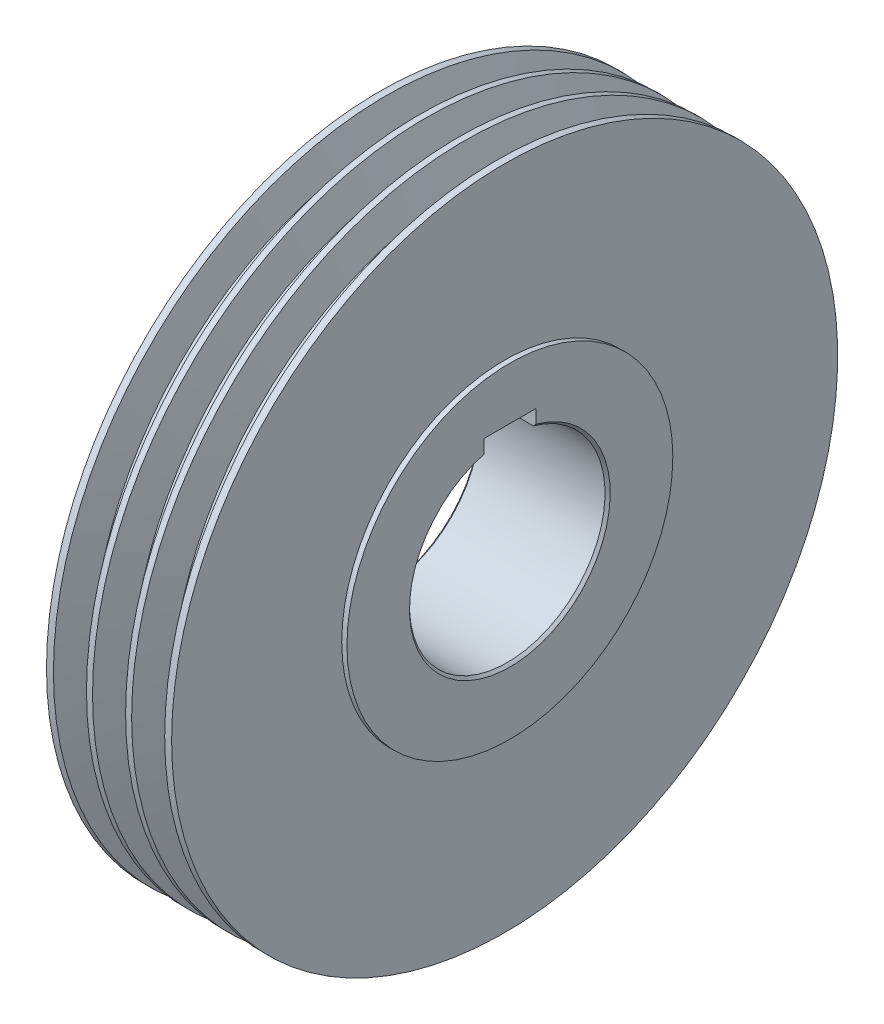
ISO-10303-21;
HEADER;
FILE_DESCRIPTION(('STEP AP214'),'2;1');
FILE_NAME('part.step','',(''),(''),'','','');
FILE_SCHEMA(('AUTOMOTIVE_DESIGN { 1 0 10303 214 1 1 1 1 }'));
ENDSEC;
DATA;
#1=APPLICATION_CONTEXT('core data for automotive mechanical design processes');
#2=APPLICATION_PROTOCOL_DEFINITION('international standard','automotive_design',2000,#1);
#3=PRODUCT_CONTEXT('',#1,'mechanical');
#4=PRODUCT('Part','Part','',(#3));
#5=PRODUCT_RELATED_PRODUCT_CATEGORY('part','',(#4));
#6=PRODUCT_DEFINITION_FORMATION('','',#4);
#7=PRODUCT_DEFINITION_CONTEXT('part definition',#1,'design');
#8=PRODUCT_DEFINITION('design','',#6,#7);
#9=PRODUCT_DEFINITION_SHAPE('','',#8);
#10=(LENGTH_UNIT() NAMED_UNIT(*) SI_UNIT(.MILLI.,.METRE.));
#11=(NAMED_UNIT(*) PLANE_ANGLE_UNIT() SI_UNIT($,.RADIAN.));
#12=(NAMED_UNIT(*) SI_UNIT($,.STERADIAN.) SOLID_ANGLE_UNIT());
#13=UNCERTAINTY_MEASURE_WITH_UNIT(LENGTH_MEASURE(1.E-05),#10,'distance_accuracy_value','');
#14=(GEOMETRIC_REPRESENTATION_CONTEXT(3) GLOBAL_UNCERTAINTY_ASSIGNED_CONTEXT((#13)) GLOBAL_UNIT_ASSIGNED_CONTEXT((#10,
#11,#12)) REPRESENTATION_CONTEXT('',''));
#15=CARTESIAN_POINT('',(0.,0.,0.));
#16=DIRECTION('',(0.,0.,1.));
#17=DIRECTION('',(1.,0.,0.));
#18=AXIS2_PLACEMENT_3D('',#15,#16,#17);
#19=CARTESIAN_POINT('',(0.,0.,0.));
#20=DIRECTION('',(-1.,0.,0.));
#21=DIRECTION('',(0.,0.,1.));
#22=AXIS2_PLACEMENT_3D('',#19,#20,#21);
#23=CYLINDRICAL_SURFACE('',#22,127.75);
#24=CARTESIAN_POINT('',(48.,0.,0.));
#25=DIRECTION('',(-1.,0.,0.));
#26=DIRECTION('',(0.,0.,1.));
#27=AXIS2_PLACEMENT_3D('',#24,#25,#26);
#28=CIRCLE('',#27,127.75);
#29=CARTESIAN_POINT('',(48.,0.,127.75));
#30=VERTEX_POINT('',#29);
#31=EDGE_CURVE('E160',#30,#30,#28,.T.);
#32=ORIENTED_EDGE('',*,*,#31,.T.);
#33=EDGE_LOOP('',(#32));
#34=FACE_BOUND('',#33,.T.);
#35=CARTESIAN_POINT('',(45.3407593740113,0.,0.));
#36=DIRECTION('',(-1.,0.,0.));
#37=DIRECTION('',(0.,0.,1.));
#38=AXIS2_PLACEMENT_3D('',#35,#36,#37);
#39=CIRCLE('',#38,127.75);
#40=CARTESIAN_POINT('',(45.3407593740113,0.,127.75));
#41=VERTEX_POINT('',#40);
#42=EDGE_CURVE('E196',#41,#41,#39,.T.);
#43=ORIENTED_EDGE('',*,*,#42,.F.);
#44=EDGE_LOOP('',(#43));
#45=FACE_BOUND('',#44,.T.);
#46=ADVANCED_FACE('F30',(#34,#45),#23,.T.);
#47=CARTESIAN_POINT('',(30.3407593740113,0.,0.));
#48=DIRECTION('',(-1.,0.,0.));
#49=DIRECTION('',(0.,0.,1.));
#50=AXIS2_PLACEMENT_3D('',#47,#48,#49);
#51=CIRCLE('',#50,127.75);
#52=CARTESIAN_POINT('',(30.3407593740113,0.,127.75));
#53=VERTEX_POINT('',#52);
#54=EDGE_CURVE('E184',#53,#53,#51,.T.);
#55=ORIENTED_EDGE('',*,*,#54,.F.);
#56=EDGE_LOOP('',(#55));
#57=FACE_BOUND('',#56,.T.);
#58=CARTESIAN_POINT('',(32.6592406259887,0.,0.));
#59=DIRECTION('',(-1.,0.,0.));
#60=DIRECTION('',(0.,0.,1.));
#61=AXIS2_PLACEMENT_3D('',#58,#59,#60);
#62=CIRCLE('',#61,127.75);
#63=CARTESIAN_POINT('',(32.6592406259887,0.,127.75));
#64=VERTEX_POINT('',#63);
#65=EDGE_CURVE('E199',#64,#64,#62,.T.);
#66=ORIENTED_EDGE('',*,*,#65,.T.);
#67=EDGE_LOOP('',(#66));
#68=FACE_BOUND('',#67,.T.);
#69=ADVANCED_FACE('F224',(#57,#68),#23,.T.);
#70=CARTESIAN_POINT('',(15.3407593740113,0.,0.));
#71=DIRECTION('',(-1.,0.,0.));
#72=DIRECTION('',(0.,0.,1.));
#73=AXIS2_PLACEMENT_3D('',#70,#71,#72);
#74=CIRCLE('',#73,127.75);
#75=CARTESIAN_POINT('',(15.3407593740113,0.,127.75));
#76=VERTEX_POINT('',#75);
#77=EDGE_CURVE('E172',#76,#76,#74,.T.);
#78=ORIENTED_EDGE('',*,*,#77,.F.);
#79=EDGE_LOOP('',(#78));
#80=FACE_BOUND('',#79,.T.);
#81=CARTESIAN_POINT('',(17.6592406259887,0.,0.));
#82=DIRECTION('',(-1.,0.,0.));
#83=DIRECTION('',(0.,0.,1.));
#84=AXIS2_PLACEMENT_3D('',#81,#82,#83);
#85=CIRCLE('',#84,127.75);
#86=CARTESIAN_POINT('',(17.6592406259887,0.,127.75));
#87=VERTEX_POINT('',#86);
#88=EDGE_CURVE('E187',#87,#87,#85,.T.);
#89=ORIENTED_EDGE('',*,*,#88,.T.);
#90=EDGE_LOOP('',(#89));
#91=FACE_BOUND('',#90,.T.);
#92=ADVANCED_FACE('F231',(#80,#91),#23,.T.);
#93=CARTESIAN_POINT('',(0.,0.,0.));
#94=DIRECTION('',(-1.,0.,0.));
#95=DIRECTION('',(0.,0.,1.));
#96=AXIS2_PLACEMENT_3D('',#93,#94,#95);
#97=CIRCLE('',#96,127.75);
#98=CARTESIAN_POINT('',(0.,0.,127.75));
#99=VERTEX_POINT('',#98);
#100=EDGE_CURVE('E157',#99,#99,#97,.T.);
#101=ORIENTED_EDGE('',*,*,#100,.F.);
#102=EDGE_LOOP('',(#101));
#103=FACE_BOUND('',#102,.T.);
#104=CARTESIAN_POINT('',(2.65924062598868,0.,0.));
#105=DIRECTION('',(-1.,0.,0.));
#106=DIRECTION('',(0.,0.,1.));
#107=AXIS2_PLACEMENT_3D('',#104,#105,#106);
#108=CIRCLE('',#107,127.75);
#109=CARTESIAN_POINT('',(2.65924062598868,0.,127.75));
#110=VERTEX_POINT('',#109);
#111=EDGE_CURVE('E175',#110,#110,#108,.T.);
#112=ORIENTED_EDGE('',*,*,#111,.T.);
#113=EDGE_LOOP('',(#112));
#114=FACE_BOUND('',#113,.T.);
#115=ADVANCED_FACE('F227',(#103,#114),#23,.T.);
#116=CARTESIAN_POINT('',(0.,0.,0.));
#117=DIRECTION('',(-1.,0.,0.));
#118=DIRECTION('',(0.,0.,1.));
#119=AXIS2_PLACEMENT_3D('',#116,#117,#118);
#120=CYLINDRICAL_SURFACE('',#119,37.5);
#121=CARTESIAN_POINT('',(1.00000000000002,0.,0.));
#122=DIRECTION('',(1.,0.,0.));
#123=DIRECTION('',(0.,0.,-1.));
#124=AXIS2_PLACEMENT_3D('',#121,#122,#123);
#125=CIRCLE('',#124,37.5);
#126=CARTESIAN_POINT('',(1.00000000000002,36.1420807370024,-10.));
#127=VERTEX_POINT('',#126);
#128=CARTESIAN_POINT('',(1.00000000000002,36.1420807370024,10.));
#129=VERTEX_POINT('',#128);
#130=EDGE_CURVE('E153',#127,#129,#125,.F.);
#131=ORIENTED_EDGE('',*,*,#130,.T.);
#132=DIRECTION('',(-1.,0.,0.));
#133=VECTOR('',#132,1.);
#134=CARTESIAN_POINT('',(50.,36.1420807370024,10.));
#135=LINE('',#134,#133);
#136=CARTESIAN_POINT('',(49.,36.1420807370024,10.));
#137=VERTEX_POINT('',#136);
#138=EDGE_CURVE('E50',#137,#129,#135,.T.);
#139=ORIENTED_EDGE('',*,*,#138,.F.);
#140=CARTESIAN_POINT('',(49.,0.,0.));
#141=DIRECTION('',(-1.,0.,0.));
#142=DIRECTION('',(0.,0.,1.));
#143=AXIS2_PLACEMENT_3D('',#140,#141,#142);
#144=CIRCLE('',#143,37.5);
#145=CARTESIAN_POINT('',(49.,36.1420807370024,-10.));
#146=VERTEX_POINT('',#145);
#147=EDGE_CURVE('E150',#137,#146,#144,.F.);
#148=ORIENTED_EDGE('',*,*,#147,.T.);
#149=DIRECTION('',(-1.,0.,0.));
#150=VECTOR('',#149,1.);
#151=CARTESIAN_POINT('',(50.,36.1420807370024,-10.));
#152=LINE('',#151,#150);
#153=EDGE_CURVE('E103',#146,#127,#152,.T.);
#154=ORIENTED_EDGE('',*,*,#153,.T.);
#155=EDGE_LOOP('',(#131,#139,#148,#154));
#156=FACE_BOUND('',#155,.T.);
#157=ADVANCED_FACE('F237',(#156),#120,.F.);
#158=CARTESIAN_POINT('',(0.,37.5,0.));
#159=DIRECTION('',(1.,0.,0.));
#160=DIRECTION('',(0.,0.,-1.));
#161=AXIS2_PLACEMENT_3D('',#158,#159,#160);
#162=PLANE('',#161);
#163=CARTESIAN_POINT('',(0.,0.,0.));
#164=DIRECTION('',(1.,0.,0.));
#165=DIRECTION('',(0.,0.,-1.));
#166=AXIS2_PLACEMENT_3D('',#163,#164,#165);
#167=CIRCLE('',#166,38.5);
#168=CARTESIAN_POINT('',(0.,37.1786228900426,10.));
#169=VERTEX_POINT('',#168);
#170=CARTESIAN_POINT('',(0.,37.1786228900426,-10.));
#171=VERTEX_POINT('',#170);
#172=EDGE_CURVE('E147',#169,#171,#167,.T.);
#173=ORIENTED_EDGE('',*,*,#172,.T.);
#174=DIRECTION('',(0.,-1.,0.));
#175=VECTOR('',#174,1.);
#176=CARTESIAN_POINT('',(0.,36.1420807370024,-10.));
#177=LINE('',#176,#175);
#178=CARTESIAN_POINT('',(0.,42.4,-10.));
#179=VERTEX_POINT('',#178);
#180=EDGE_CURVE('E115',#179,#171,#177,.T.);
#181=ORIENTED_EDGE('',*,*,#180,.F.);
#182=DIRECTION('',(0.,0.,-1.));
#183=VECTOR('',#182,1.);
#184=CARTESIAN_POINT('',(0.,42.4,-10.));
#185=LINE('',#184,#183);
#186=CARTESIAN_POINT('',(0.,42.4,10.));
#187=VERTEX_POINT('',#186);
#188=EDGE_CURVE('E112',#187,#179,#185,.T.);
#189=ORIENTED_EDGE('',*,*,#188,.F.);
#190=DIRECTION('',(0.,1.,0.));
#191=VECTOR('',#190,1.);
#192=CARTESIAN_POINT('',(0.,36.1420807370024,10.));
#193=LINE('',#192,#191);
#194=EDGE_CURVE('E93',#169,#187,#193,.T.);
#195=ORIENTED_EDGE('',*,*,#194,.F.);
#196=EDGE_LOOP('',(#173,#181,#189,#195));
#197=FACE_BOUND('',#196,.T.);
#198=ORIENTED_EDGE('',*,*,#100,.T.);
#199=EDGE_LOOP('',(#198));
#200=FACE_BOUND('',#199,.T.);
#201=ADVANCED_FACE('F243',(#197,#200),#162,.F.);
#202=CARTESIAN_POINT('',(48.,127.75,0.));
#203=DIRECTION('',(-1.,0.,0.));
#204=DIRECTION('',(0.,0.,1.));
#205=AXIS2_PLACEMENT_3D('',#202,#203,#204);
#206=PLANE('',#205);
#207=ORIENTED_EDGE('',*,*,#31,.F.);
#208=EDGE_LOOP('',(#207));
#209=FACE_BOUND('',#208,.T.);
#210=CARTESIAN_POINT('',(48.,0.,0.));
#211=DIRECTION('',(-1.,0.,0.));
#212=DIRECTION('',(0.,0.,1.));
#213=AXIS2_PLACEMENT_3D('',#210,#211,#212);
#214=CIRCLE('',#213,62.5);
#215=CARTESIAN_POINT('',(48.,0.,62.5));
#216=VERTEX_POINT('',#215);
#217=EDGE_CURVE('E163',#216,#216,#214,.T.);
#218=ORIENTED_EDGE('',*,*,#217,.T.);
#219=EDGE_LOOP('',(#218));
#220=FACE_BOUND('',#219,.T.);
#221=ADVANCED_FACE('F274',(#209,#220),#206,.F.);
#222=CARTESIAN_POINT('',(0.,0.,0.));
#223=DIRECTION('',(-1.,0.,0.));
#224=DIRECTION('',(0.,0.,1.));
#225=AXIS2_PLACEMENT_3D('',#222,#223,#224);
#226=CYLINDRICAL_SURFACE('',#225,62.5);
#227=ORIENTED_EDGE('',*,*,#217,.F.);
#228=EDGE_LOOP('',(#227));
#229=FACE_BOUND('',#228,.T.);
#230=CARTESIAN_POINT('',(50.,0.,0.));
#231=DIRECTION('',(-1.,0.,0.));
#232=DIRECTION('',(0.,0.,1.));
#233=AXIS2_PLACEMENT_3D('',#230,#231,#232);
#234=CIRCLE('',#233,62.5);
#235=CARTESIAN_POINT('',(50.,0.,62.5));
#236=VERTEX_POINT('',#235);
#237=EDGE_CURVE('E166',#236,#236,#234,.T.);
#238=ORIENTED_EDGE('',*,*,#237,.T.);
#239=EDGE_LOOP('',(#238));
#240=FACE_BOUND('',#239,.T.);
#241=ADVANCED_FACE('F272',(#229,#240),#226,.T.);
#242=CARTESIAN_POINT('',(50.,62.5,0.));
#243=DIRECTION('',(-1.,0.,0.));
#244=DIRECTION('',(0.,0.,1.));
#245=AXIS2_PLACEMENT_3D('',#242,#243,#244);
#246=PLANE('',#245);
#247=DIRECTION('',(0.,0.,-1.));
#248=VECTOR('',#247,1.);
#249=CARTESIAN_POINT('',(50.,42.4,-10.));
#250=LINE('',#249,#248);
#251=CARTESIAN_POINT('',(50.,42.4,10.));
#252=VERTEX_POINT('',#251);
#253=CARTESIAN_POINT('',(50.,42.4,-10.));
#254=VERTEX_POINT('',#253);
#255=EDGE_CURVE('E100',#252,#254,#250,.T.);
#256=ORIENTED_EDGE('',*,*,#255,.T.);
#257=DIRECTION('',(0.,-1.,0.));
#258=VECTOR('',#257,1.);
#259=CARTESIAN_POINT('',(50.,36.1420807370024,-10.));
#260=LINE('',#259,#258);
#261=CARTESIAN_POINT('',(50.,37.1786228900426,-10.));
#262=VERTEX_POINT('',#261);
#263=EDGE_CURVE('E110',#254,#262,#260,.T.);
#264=ORIENTED_EDGE('',*,*,#263,.T.);
#265=CARTESIAN_POINT('',(50.,0.,0.));
#266=DIRECTION('',(-1.,0.,0.));
#267=DIRECTION('',(0.,0.,1.));
#268=AXIS2_PLACEMENT_3D('',#265,#266,#267);
#269=CIRCLE('',#268,38.5);
#270=CARTESIAN_POINT('',(50.,37.1786228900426,10.));
#271=VERTEX_POINT('',#270);
#272=EDGE_CURVE('E109',#262,#271,#269,.T.);
#273=ORIENTED_EDGE('',*,*,#272,.T.);
#274=DIRECTION('',(0.,1.,0.));
#275=VECTOR('',#274,1.);
#276=CARTESIAN_POINT('',(50.,36.1420807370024,10.));
#277=LINE('',#276,#275);
#278=EDGE_CURVE('E90',#271,#252,#277,.T.);
#279=ORIENTED_EDGE('',*,*,#278,.T.);
#280=EDGE_LOOP('',(#256,#264,#273,#279));
#281=FACE_BOUND('',#280,.T.);
#282=ORIENTED_EDGE('',*,*,#237,.F.);
#283=EDGE_LOOP('',(#282));
#284=FACE_BOUND('',#283,.T.);
#285=ADVANCED_FACE('F106',(#281,#284),#246,.F.);
#286=CARTESIAN_POINT('',(0.,0.,0.));
#287=DIRECTION('',(-1.,0.,0.));
#288=DIRECTION('',(0.,0.,1.));
#289=AXIS2_PLACEMENT_3D('',#286,#287,#288);
#290=CYLINDRICAL_SURFACE('',#289,116.3);
#291=CARTESIAN_POINT('',(11.8401430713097,0.,0.));
#292=DIRECTION('',(-1.,0.,0.));
#293=DIRECTION('',(0.,0.,1.));
#294=AXIS2_PLACEMENT_3D('',#291,#292,#293);
#295=CIRCLE('',#294,116.3);
#296=CARTESIAN_POINT('',(11.8401430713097,0.,116.3));
#297=VERTEX_POINT('',#296);
#298=EDGE_CURVE('E169',#297,#297,#295,.T.);
#299=ORIENTED_EDGE('',*,*,#298,.T.);
#300=EDGE_LOOP('',(#299));
#301=FACE_BOUND('',#300,.T.);
#302=CARTESIAN_POINT('',(6.1598569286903,0.,0.));
#303=DIRECTION('',(-1.,0.,0.));
#304=DIRECTION('',(0.,0.,1.));
#305=AXIS2_PLACEMENT_3D('',#302,#303,#304);
#306=CIRCLE('',#305,116.3);
#307=CARTESIAN_POINT('',(6.1598569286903,0.,116.3));
#308=VERTEX_POINT('',#307);
#309=EDGE_CURVE('E178',#308,#308,#306,.T.);
#310=ORIENTED_EDGE('',*,*,#309,.F.);
#311=EDGE_LOOP('',(#310));
#312=FACE_BOUND('',#311,.T.);
#313=ADVANCED_FACE('F262',(#301,#312),#290,.T.);
#314=CARTESIAN_POINT('',(11.8401430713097,0.,0.));
#315=DIRECTION('',(1.,0.,0.));
#316=DIRECTION('',(0.,0.,-1.));
#317=AXIS2_PLACEMENT_3D('',#314,#315,#316);
#318=CONICAL_SURFACE('',#317,116.3,1.27409035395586);
#319=ORIENTED_EDGE('',*,*,#77,.T.);
#320=EDGE_LOOP('',(#319));
#321=FACE_BOUND('',#320,.T.);
#322=ORIENTED_EDGE('',*,*,#298,.F.);
#323=EDGE_LOOP('',(#322));
#324=FACE_BOUND('',#323,.T.);
#325=ADVANCED_FACE('F253',(#321,#324),#318,.T.);
#326=CARTESIAN_POINT('',(2.65924062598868,0.,0.));
#327=DIRECTION('',(-1.,0.,0.));
#328=DIRECTION('',(0.,0.,1.));
#329=AXIS2_PLACEMENT_3D('',#326,#327,#328);
#330=CONICAL_SURFACE('',#329,127.75,1.27409035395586);
#331=ORIENTED_EDGE('',*,*,#309,.T.);
#332=EDGE_LOOP('',(#331));
#333=FACE_BOUND('',#332,.T.);
#334=ORIENTED_EDGE('',*,*,#111,.F.);
#335=EDGE_LOOP('',(#334));
#336=FACE_BOUND('',#335,.T.);
#337=ADVANCED_FACE('F250',(#333,#336),#330,.T.);
#338=CARTESIAN_POINT('',(15.,0.,0.));
#339=DIRECTION('',(-1.,0.,0.));
#340=DIRECTION('',(0.,0.,1.));
#341=AXIS2_PLACEMENT_3D('',#338,#339,#340);
#342=CYLINDRICAL_SURFACE('',#341,116.3);
#343=CARTESIAN_POINT('',(26.8401430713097,0.,0.));
#344=DIRECTION('',(-1.,0.,0.));
#345=DIRECTION('',(0.,0.,1.));
#346=AXIS2_PLACEMENT_3D('',#343,#344,#345);
#347=CIRCLE('',#346,116.3);
#348=CARTESIAN_POINT('',(26.8401430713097,0.,116.3));
#349=VERTEX_POINT('',#348);
#350=EDGE_CURVE('E181',#349,#349,#347,.T.);
#351=ORIENTED_EDGE('',*,*,#350,.T.);
#352=EDGE_LOOP('',(#351));
#353=FACE_BOUND('',#352,.T.);
#354=CARTESIAN_POINT('',(21.1598569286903,0.,0.));
#355=DIRECTION('',(-1.,0.,0.));
#356=DIRECTION('',(0.,0.,1.));
#357=AXIS2_PLACEMENT_3D('',#354,#355,#356);
#358=CIRCLE('',#357,116.3);
#359=CARTESIAN_POINT('',(21.1598569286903,0.,116.3));
#360=VERTEX_POINT('',#359);
#361=EDGE_CURVE('E190',#360,#360,#358,.T.);
#362=ORIENTED_EDGE('',*,*,#361,.F.);
#363=EDGE_LOOP('',(#362));
#364=FACE_BOUND('',#363,.T.);
#365=ADVANCED_FACE('F252',(#353,#364),#342,.T.);
#366=CARTESIAN_POINT('',(26.8401430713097,0.,0.));
#367=DIRECTION('',(1.,0.,0.));
#368=DIRECTION('',(0.,0.,-1.));
#369=AXIS2_PLACEMENT_3D('',#366,#367,#368);
#370=CONICAL_SURFACE('',#369,116.3,1.27409035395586);
#371=ORIENTED_EDGE('',*,*,#54,.T.);
#372=EDGE_LOOP('',(#371));
#373=FACE_BOUND('',#372,.T.);
#374=ORIENTED_EDGE('',*,*,#350,.F.);
#375=EDGE_LOOP('',(#374));
#376=FACE_BOUND('',#375,.T.);
#377=ADVANCED_FACE('F220',(#373,#376),#370,.T.);
#378=CARTESIAN_POINT('',(17.6592406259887,0.,0.));
#379=DIRECTION('',(-1.,0.,0.));
#380=DIRECTION('',(0.,0.,1.));
#381=AXIS2_PLACEMENT_3D('',#378,#379,#380);
#382=CONICAL_SURFACE('',#381,127.75,1.27409035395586);
#383=ORIENTED_EDGE('',*,*,#361,.T.);
#384=EDGE_LOOP('',(#383));
#385=FACE_BOUND('',#384,.T.);
#386=ORIENTED_EDGE('',*,*,#88,.F.);
#387=EDGE_LOOP('',(#386));
#388=FACE_BOUND('',#387,.T.);
#389=ADVANCED_FACE('F211',(#385,#388),#382,.T.);
#390=CARTESIAN_POINT('',(30.,0.,0.));
#391=DIRECTION('',(-1.,0.,0.));
#392=DIRECTION('',(0.,0.,1.));
#393=AXIS2_PLACEMENT_3D('',#390,#391,#392);
#394=CYLINDRICAL_SURFACE('',#393,116.3);
#395=CARTESIAN_POINT('',(41.8401430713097,0.,0.));
#396=DIRECTION('',(-1.,0.,0.));
#397=DIRECTION('',(0.,0.,1.));
#398=AXIS2_PLACEMENT_3D('',#395,#396,#397);
#399=CIRCLE('',#398,116.3);
#400=CARTESIAN_POINT('',(41.8401430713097,0.,116.3));
#401=VERTEX_POINT('',#400);
#402=EDGE_CURVE('E193',#401,#401,#399,.T.);
#403=ORIENTED_EDGE('',*,*,#402,.T.);
#404=EDGE_LOOP('',(#403));
#405=FACE_BOUND('',#404,.T.);
#406=CARTESIAN_POINT('',(36.1598569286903,0.,0.));
#407=DIRECTION('',(-1.,0.,0.));
#408=DIRECTION('',(0.,0.,1.));
#409=AXIS2_PLACEMENT_3D('',#406,#407,#408);
#410=CIRCLE('',#409,116.3);
#411=CARTESIAN_POINT('',(36.1598569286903,0.,116.3));
#412=VERTEX_POINT('',#411);
#413=EDGE_CURVE('E201',#412,#412,#410,.T.);
#414=ORIENTED_EDGE('',*,*,#413,.F.);
#415=EDGE_LOOP('',(#414));
#416=FACE_BOUND('',#415,.T.);
#417=ADVANCED_FACE('F208',(#405,#416),#394,.T.);
#418=CARTESIAN_POINT('',(41.8401430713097,0.,0.));
#419=DIRECTION('',(1.,0.,0.));
#420=DIRECTION('',(0.,0.,-1.));
#421=AXIS2_PLACEMENT_3D('',#418,#419,#420);
#422=CONICAL_SURFACE('',#421,116.3,1.27409035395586);
#423=ORIENTED_EDGE('',*,*,#42,.T.);
#424=EDGE_LOOP('',(#423));
#425=FACE_BOUND('',#424,.T.);
#426=ORIENTED_EDGE('',*,*,#402,.F.);
#427=EDGE_LOOP('',(#426));
#428=FACE_BOUND('',#427,.T.);
#429=ADVANCED_FACE('F210',(#425,#428),#422,.T.);
#430=CARTESIAN_POINT('',(32.6592406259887,0.,0.));
#431=DIRECTION('',(-1.,0.,0.));
#432=DIRECTION('',(0.,0.,1.));
#433=AXIS2_PLACEMENT_3D('',#430,#431,#432);
#434=CONICAL_SURFACE('',#433,127.75,1.27409035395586);
#435=ORIENTED_EDGE('',*,*,#413,.T.);
#436=EDGE_LOOP('',(#435));
#437=FACE_BOUND('',#436,.T.);
#438=ORIENTED_EDGE('',*,*,#65,.F.);
#439=EDGE_LOOP('',(#438));
#440=FACE_BOUND('',#439,.T.);
#441=ADVANCED_FACE('F205',(#437,#440),#434,.T.);
#442=CARTESIAN_POINT('',(50.,0.,0.));
#443=DIRECTION('',(1.,0.,0.));
#444=DIRECTION('',(0.,0.,-1.));
#445=AXIS2_PLACEMENT_3D('',#442,#443,#444);
#446=CONICAL_SURFACE('',#445,38.5,0.785398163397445);
#447=CARTESIAN_POINT('',(45.712114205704,32.7180188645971,-10.));
#448=CARTESIAN_POINT('',(46.3033714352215,33.336262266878,-10.));
#449=CARTESIAN_POINT('',(46.8953617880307,33.9538037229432,-10.));
#450=CARTESIAN_POINT('',(48.0806180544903,35.1876576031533,-10.));
#451=CARTESIAN_POINT('',(48.6738839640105,35.8039700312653,-10.));
#452=CARTESIAN_POINT('',(49.8615039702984,37.0355441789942,-10.));
#453=CARTESIAN_POINT('',(50.4558580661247,37.6508058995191,-10.));
#454=CARTESIAN_POINT('',(51.6455169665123,38.8804134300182,-10.));
#455=CARTESIAN_POINT('',(52.2408217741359,39.4947592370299,-10.));
#456=CARTESIAN_POINT('',(52.8365310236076,40.1087122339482,-10.));
#457=B_SPLINE_CURVE_WITH_KNOTS('',3,(#447,#448,#449,#450,#451,#452,#453,#454,#455,#456),
.UNSPECIFIED.,.F.,.F.,(4,2,2,2,4),(0.,2.56637539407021,5.13274249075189,7.69910736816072,
10.2654805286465),.UNSPECIFIED.);
#458=EDGE_CURVE('E58',#146,#262,#457,.T.);
#459=ORIENTED_EDGE('',*,*,#458,.F.);
#460=ORIENTED_EDGE('',*,*,#147,.F.);
#461=CARTESIAN_POINT('',(52.8365310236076,40.1087122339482,10.));
#462=CARTESIAN_POINT('',(52.2408217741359,39.4947592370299,10.));
#463=CARTESIAN_POINT('',(51.6455169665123,38.8804134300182,10.));
#464=CARTESIAN_POINT('',(50.4558580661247,37.6508058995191,10.));
#465=CARTESIAN_POINT('',(49.8615039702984,37.0355441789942,10.));
#466=CARTESIAN_POINT('',(48.6738839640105,35.8039700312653,10.));
#467=CARTESIAN_POINT('',(48.0806180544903,35.1876576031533,10.));
#468=CARTESIAN_POINT('',(46.8953617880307,33.9538037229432,10.));
#469=CARTESIAN_POINT('',(46.3033714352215,33.336262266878,10.));
#470=CARTESIAN_POINT('',(45.712114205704,32.7180188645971,10.));
#471=B_SPLINE_CURVE_WITH_KNOTS('',3,(#461,#462,#463,#464,#465,#466,#467,#468,#469,#470),
.UNSPECIFIED.,.F.,.F.,(4,2,2,2,4),(0.,2.56637316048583,5.13273803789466,7.69910513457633,
10.2654805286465),.UNSPECIFIED.);
#472=EDGE_CURVE('E119',#271,#137,#471,.T.);
#473=ORIENTED_EDGE('',*,*,#472,.F.);
#474=ORIENTED_EDGE('',*,*,#272,.F.);
#475=EDGE_LOOP('',(#459,#460,#473,#474));
#476=FACE_BOUND('',#475,.T.);
#477=ADVANCED_FACE('F133',(#476),#446,.F.);
#478=CARTESIAN_POINT('',(1.00000000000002,0.,0.));
#479=DIRECTION('',(-1.,0.,0.));
#480=DIRECTION('',(0.,0.,1.));
#481=AXIS2_PLACEMENT_3D('',#478,#479,#480);
#482=CONICAL_SURFACE('',#481,37.5,0.785398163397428);
#483=CARTESIAN_POINT('',(-3.0782473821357,40.3577830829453,-10.));
#484=CARTESIAN_POINT('',(-2.48242757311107,39.7439375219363,-10.));
#485=CARTESIAN_POINT('',(-1.88700501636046,39.1297060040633,-10.));
#486=CARTESIAN_POINT('',(-0.697092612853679,37.9003439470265,-10.));
#487=CARTESIAN_POINT('',(-0.102602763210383,37.2852134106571,-10.));
#488=CARTESIAN_POINT('',(1.0853102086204,36.0539218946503,-10.));
#489=CARTESIAN_POINT('',(1.67873332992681,35.4377609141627,-10.));
#490=CARTESIAN_POINT('',(2.86433059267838,34.2042349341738,-10.));
#491=CARTESIAN_POINT('',(3.45650473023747,33.5868699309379,-10.));
#492=CARTESIAN_POINT('',(4.04796165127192,32.9688177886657,-10.));
#493=B_SPLINE_CURVE_WITH_KNOTS('',3,(#483,#484,#485,#486,#487,#488,#489,#490,#491,#492),
.UNSPECIFIED.,.F.,.F.,(4,2,2,2,4),(0.,2.56637284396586,5.13273772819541,7.69910473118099,
10.2654797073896),.UNSPECIFIED.);
#494=EDGE_CURVE('E11',#171,#127,#493,.T.);
#495=ORIENTED_EDGE('',*,*,#494,.F.);
#496=ORIENTED_EDGE('',*,*,#172,.F.);
#497=CARTESIAN_POINT('',(4.04796165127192,32.9688177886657,10.));
#498=CARTESIAN_POINT('',(3.45650473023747,33.5868699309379,10.));
#499=CARTESIAN_POINT('',(2.86433059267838,34.2042349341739,10.));
#500=CARTESIAN_POINT('',(1.6787333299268,35.4377609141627,10.));
#501=CARTESIAN_POINT('',(1.0853102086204,36.0539218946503,10.));
#502=CARTESIAN_POINT('',(-0.102602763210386,37.2852134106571,10.));
#503=CARTESIAN_POINT('',(-0.69709261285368,37.9003439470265,10.));
#504=CARTESIAN_POINT('',(-1.88700501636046,39.1297060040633,10.));
#505=CARTESIAN_POINT('',(-2.48242757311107,39.7439375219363,10.));
#506=CARTESIAN_POINT('',(-3.0782473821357,40.3577830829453,10.));
#507=B_SPLINE_CURVE_WITH_KNOTS('',3,(#497,#498,#499,#500,#501,#502,#503,#504,#505,#506),
.UNSPECIFIED.,.F.,.F.,(4,2,2,2,4),(0.,2.56637497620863,5.1327419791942,7.69910686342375,
10.2654797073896),.UNSPECIFIED.);
#508=EDGE_CURVE('E43',#129,#169,#507,.T.);
#509=ORIENTED_EDGE('',*,*,#508,.F.);
#510=ORIENTED_EDGE('',*,*,#130,.F.);
#511=EDGE_LOOP('',(#495,#496,#509,#510));
#512=FACE_BOUND('',#511,.T.);
#513=ADVANCED_FACE('F32',(#512),#482,.F.);
#514=CARTESIAN_POINT('',(50.,36.1420807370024,-10.));
#515=DIRECTION('',(0.,0.,-1.));
#516=DIRECTION('',(-1.,0.,0.));
#517=AXIS2_PLACEMENT_3D('',#514,#515,#516);
#518=PLANE('',#517);
#519=ORIENTED_EDGE('',*,*,#458,.T.);
#520=ORIENTED_EDGE('',*,*,#263,.F.);
#521=DIRECTION('',(-1.,0.,0.));
#522=VECTOR('',#521,1.);
#523=CARTESIAN_POINT('',(50.,42.4,-10.));
#524=LINE('',#523,#522);
#525=EDGE_CURVE('E97',#254,#179,#524,.T.);
#526=ORIENTED_EDGE('',*,*,#525,.T.);
#527=ORIENTED_EDGE('',*,*,#180,.T.);
#528=ORIENTED_EDGE('',*,*,#494,.T.);
#529=ORIENTED_EDGE('',*,*,#153,.F.);
#530=EDGE_LOOP('',(#519,#520,#526,#527,#528,#529));
#531=FACE_BOUND('',#530,.T.);
#532=ADVANCED_FACE('F139',(#531),#518,.F.);
#533=CARTESIAN_POINT('',(50.,42.4,-10.));
#534=DIRECTION('',(0.,1.,0.));
#535=DIRECTION('',(0.,0.,1.));
#536=AXIS2_PLACEMENT_3D('',#533,#534,#535);
#537=PLANE('',#536);
#538=ORIENTED_EDGE('',*,*,#188,.T.);
#539=ORIENTED_EDGE('',*,*,#525,.F.);
#540=ORIENTED_EDGE('',*,*,#255,.F.);
#541=DIRECTION('',(-1.,0.,0.));
#542=VECTOR('',#541,1.);
#543=CARTESIAN_POINT('',(50.,42.4,10.));
#544=LINE('',#543,#542);
#545=EDGE_CURVE('E86',#252,#187,#544,.T.);
#546=ORIENTED_EDGE('',*,*,#545,.T.);
#547=EDGE_LOOP('',(#538,#539,#540,#546));
#548=FACE_BOUND('',#547,.T.);
#549=ADVANCED_FACE('F101',(#548),#537,.F.);
#550=CARTESIAN_POINT('',(50.,36.1420807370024,10.));
#551=DIRECTION('',(0.,0.,1.));
#552=DIRECTION('',(1.,0.,0.));
#553=AXIS2_PLACEMENT_3D('',#550,#551,#552);
#554=PLANE('',#553);
#555=ORIENTED_EDGE('',*,*,#472,.T.);
#556=ORIENTED_EDGE('',*,*,#138,.T.);
#557=ORIENTED_EDGE('',*,*,#508,.T.);
#558=ORIENTED_EDGE('',*,*,#194,.T.);
#559=ORIENTED_EDGE('',*,*,#545,.F.);
#560=ORIENTED_EDGE('',*,*,#278,.F.);
#561=EDGE_LOOP('',(#555,#556,#557,#558,#559,#560));
#562=FACE_BOUND('',#561,.T.);
#563=ADVANCED_FACE('F88',(#562),#554,.F.);
#564=CLOSED_SHELL('',(#46,#69,#92,#115,#157,#201,#221,#241,#285,#313,#325,#337,#365,#377,#389,
#417,#429,#441,#477,#513,#532,#549,#563));
#565=MANIFOLD_SOLID_BREP('B2',#564);
#566=ADVANCED_BREP_SHAPE_REPRESENTATION('',(#18,#565),#14);
#567=SHAPE_DEFINITION_REPRESENTATION(#9,#566);
ENDSEC;
END-ISO-10303-21;
